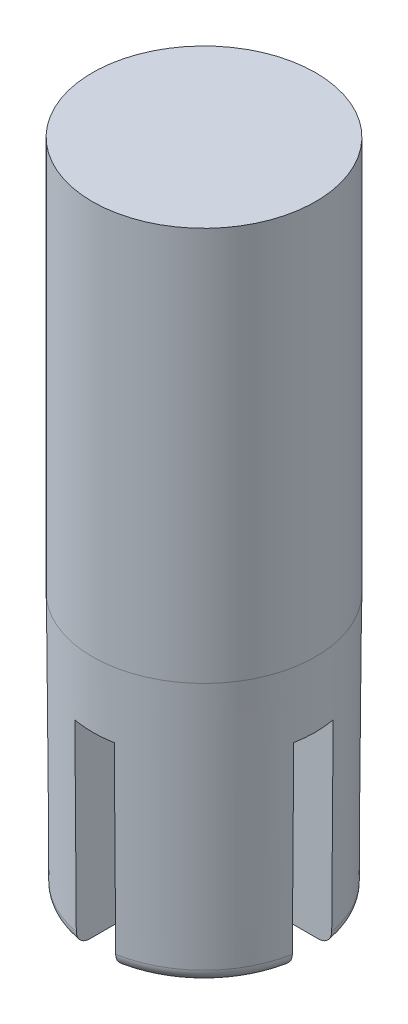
ISO-10303-21;
HEADER;
FILE_DESCRIPTION(('STEP AP214'),'2;1');
FILE_NAME('part.step','',(''),(''),'','','');
FILE_SCHEMA(('AUTOMOTIVE_DESIGN { 1 0 10303 214 1 1 1 1 }'));
ENDSEC;
DATA;
#1=APPLICATION_CONTEXT('core data for automotive mechanical design processes');
#2=APPLICATION_PROTOCOL_DEFINITION('international standard','automotive_design',2000,#1);
#3=PRODUCT_CONTEXT('',#1,'mechanical');
#4=PRODUCT('Part','Part','',(#3));
#5=PRODUCT_RELATED_PRODUCT_CATEGORY('part','',(#4));
#6=PRODUCT_DEFINITION_FORMATION('','',#4);
#7=PRODUCT_DEFINITION_CONTEXT('part definition',#1,'design');
#8=PRODUCT_DEFINITION('design','',#6,#7);
#9=PRODUCT_DEFINITION_SHAPE('','',#8);
#10=(LENGTH_UNIT() NAMED_UNIT(*) SI_UNIT(.MILLI.,.METRE.));
#11=(NAMED_UNIT(*) PLANE_ANGLE_UNIT() SI_UNIT($,.RADIAN.));
#12=(NAMED_UNIT(*) SI_UNIT($,.STERADIAN.) SOLID_ANGLE_UNIT());
#13=UNCERTAINTY_MEASURE_WITH_UNIT(LENGTH_MEASURE(1.E-05),#10,'distance_accuracy_value','');
#14=(GEOMETRIC_REPRESENTATION_CONTEXT(3) GLOBAL_UNCERTAINTY_ASSIGNED_CONTEXT((#13)) GLOBAL_UNIT_ASSIGNED_CONTEXT((#10,
#11,#12)) REPRESENTATION_CONTEXT('',''));
#15=CARTESIAN_POINT('',(0.,0.,0.));
#16=DIRECTION('',(0.,0.,1.));
#17=DIRECTION('',(1.,0.,0.));
#18=AXIS2_PLACEMENT_3D('',#15,#16,#17);
#19=CARTESIAN_POINT('',(-8.5,-66.,0.));
#20=DIRECTION('',(0.,-1.,0.));
#21=DIRECTION('',(0.,0.,-1.));
#22=AXIS2_PLACEMENT_3D('',#19,#20,#21);
#23=PLANE('',#22);
#24=DIRECTION('',(0.,0.,-1.));
#25=VECTOR('',#24,1.);
#26=CARTESIAN_POINT('',(-1.5,-66.,9.));
#27=LINE('',#26,#25);
#28=CARTESIAN_POINT('',(-1.5,-66.,7.20294331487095));
#29=VERTEX_POINT('',#28);
#30=CARTESIAN_POINT('',(-1.5,-66.,1.5));
#31=VERTEX_POINT('',#30);
#32=EDGE_CURVE('E335',#29,#31,#27,.T.);
#33=ORIENTED_EDGE('',*,*,#32,.F.);
#34=CARTESIAN_POINT('',(0.,-66.,0.));
#35=DIRECTION('',(0.,-1.,0.));
#36=DIRECTION('',(0.,0.,-1.));
#37=AXIS2_PLACEMENT_3D('',#34,#35,#36);
#38=CIRCLE('',#37,7.35747187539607);
#39=CARTESIAN_POINT('',(-7.20294331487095,-66.,1.5));
#40=VERTEX_POINT('',#39);
#41=EDGE_CURVE('E338',#29,#40,#38,.T.);
#42=ORIENTED_EDGE('',*,*,#41,.T.);
#43=DIRECTION('',(-1.,0.,0.));
#44=VECTOR('',#43,1.);
#45=CARTESIAN_POINT('',(9.,-66.,1.5));
#46=LINE('',#45,#44);
#47=EDGE_CURVE('E164',#31,#40,#46,.T.);
#48=ORIENTED_EDGE('',*,*,#47,.F.);
#49=EDGE_LOOP('',(#33,#42,#48));
#50=FACE_BOUND('',#49,.T.);
#51=ADVANCED_FACE('F16',(#50),#23,.T.);
#52=DIRECTION('',(1.,0.,0.));
#53=VECTOR('',#52,1.);
#54=CARTESIAN_POINT('',(9.,-66.,-1.5));
#55=LINE('',#54,#53);
#56=CARTESIAN_POINT('',(-7.20294331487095,-66.,-1.5));
#57=VERTEX_POINT('',#56);
#58=CARTESIAN_POINT('',(-1.5,-66.,-1.5));
#59=VERTEX_POINT('',#58);
#60=EDGE_CURVE('E161',#57,#59,#55,.T.);
#61=ORIENTED_EDGE('',*,*,#60,.F.);
#62=CARTESIAN_POINT('',(0.,-66.,0.));
#63=DIRECTION('',(0.,-1.,0.));
#64=DIRECTION('',(0.,0.,-1.));
#65=AXIS2_PLACEMENT_3D('',#62,#63,#64);
#66=CIRCLE('',#65,7.35747187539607);
#67=CARTESIAN_POINT('',(-1.5,-66.,-7.20294331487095));
#68=VERTEX_POINT('',#67);
#69=EDGE_CURVE('E248',#57,#68,#66,.T.);
#70=ORIENTED_EDGE('',*,*,#69,.T.);
#71=EDGE_CURVE('E418',#59,#68,#27,.T.);
#72=ORIENTED_EDGE('',*,*,#71,.F.);
#73=EDGE_LOOP('',(#61,#70,#72));
#74=FACE_BOUND('',#73,.T.);
#75=ADVANCED_FACE('F369',(#74),#23,.T.);
#76=CARTESIAN_POINT('',(9.,-51.,1.5));
#77=DIRECTION('',(0.,0.,1.));
#78=DIRECTION('',(1.,0.,0.));
#79=AXIS2_PLACEMENT_3D('',#76,#77,#78);
#80=PLANE('',#79);
#81=ORIENTED_EDGE('',*,*,#47,.T.);
#82=CARTESIAN_POINT('',(-7.20294331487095,-66.,1.5));
#83=CARTESIAN_POINT('',(-7.26111337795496,-66.0000452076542,1.5));
#84=CARTESIAN_POINT('',(-7.31928035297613,-65.9951377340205,1.5));
#85=CARTESIAN_POINT('',(-7.4339806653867,-65.9757080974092,1.5));
#86=CARTESIAN_POINT('',(-7.49051415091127,-65.961186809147,1.5));
#87=CARTESIAN_POINT('',(-7.60037486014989,-65.9228048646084,1.5));
#88=CARTESIAN_POINT('',(-7.65369949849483,-65.8989367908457,1.5));
#89=CARTESIAN_POINT('',(-7.75550067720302,-65.8424944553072,1.5));
#90=CARTESIAN_POINT('',(-7.80397914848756,-65.8099236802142,1.5));
#91=CARTESIAN_POINT('',(-7.89410785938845,-65.7373720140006,1.5));
#92=CARTESIAN_POINT('',(-7.93583076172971,-65.6974814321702,1.5));
#93=CARTESIAN_POINT('',(-8.01184875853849,-65.6111356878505,1.5));
#94=CARTESIAN_POINT('',(-8.04614248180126,-65.5646793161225,1.5));
#95=CARTESIAN_POINT('',(-8.10567289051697,-65.467423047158,1.5));
#96=CARTESIAN_POINT('',(-8.13105895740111,-65.4167144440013,1.5));
#97=CARTESIAN_POINT('',(-8.17279851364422,-65.311729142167,1.5));
#98=CARTESIAN_POINT('',(-8.1891600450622,-65.257455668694,1.5));
#99=CARTESIAN_POINT('',(-8.20748235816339,-65.1701961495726,1.5));
#100=CARTESIAN_POINT('',(-8.21260524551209,-65.1378419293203,1.5));
#101=CARTESIAN_POINT('',(-8.21960372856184,-65.0728342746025,1.5));
#102=CARTESIAN_POINT('',(-8.2214842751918,-65.0401813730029,1.5));
#103=CARTESIAN_POINT('',(-8.22173132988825,-65.0074997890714,1.5));
#104=B_SPLINE_CURVE_WITH_KNOTS('',3,(#82,#83,#84,#85,#86,#87,#88,#89,#90,#91,#92,#93,#94,#95,
#96,#97,#98,#99,#100,#101,#102,#103),.UNSPECIFIED.,.F.,.F.,(4,2,2,2,2,2,2,2,2,2,4),(0.,
0.174300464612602,0.348585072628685,0.523008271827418,0.697361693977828,0.869693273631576,
1.04205663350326,1.21137321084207,1.38053865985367,1.47866364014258,1.57663865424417),.UNSPECIFIED.);
#105=CARTESIAN_POINT('',(-8.22173132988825,-65.0074997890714,1.5));
#106=VERTEX_POINT('',#105);
#107=EDGE_CURVE('E30',#40,#106,#104,.T.);
#108=ORIENTED_EDGE('',*,*,#107,.T.);
#109=CARTESIAN_POINT('',(-8.10174468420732,-80.7421795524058,1.5));
#110=CARTESIAN_POINT('',(-8.14395734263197,-75.2078775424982,1.5));
#111=CARTESIAN_POINT('',(-8.18615910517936,-69.6735754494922,1.5));
#112=CARTESIAN_POINT('',(-8.27054175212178,-58.6049711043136,1.5));
#113=CARTESIAN_POINT('',(-8.31272263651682,-53.0706688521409,1.5));
#114=CARTESIAN_POINT('',(-8.46127619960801,-33.575227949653,1.5));
#115=CARTESIAN_POINT('',(-8.56759533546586,-19.6140888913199,1.5));
#116=CARTESIAN_POINT('',(-8.67385827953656,-5.6529494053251,1.5));
#117=B_SPLINE_CURVE_WITH_KNOTS('',3,(#109,#110,#111,#112,#113,#114,#115,#116),.UNSPECIFIED.,.F.,
.F.,(4,2,2,4),(0.,16.6033889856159,33.2067779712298,75.0914096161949),.UNSPECIFIED.);
#118=CARTESIAN_POINT('',(-8.3284996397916,-51.,1.5));
#119=VERTEX_POINT('',#118);
#120=EDGE_CURVE('E316',#106,#119,#117,.T.);
#121=ORIENTED_EDGE('',*,*,#120,.T.);
#122=DIRECTION('',(-1.,0.,0.));
#123=VECTOR('',#122,1.);
#124=CARTESIAN_POINT('',(9.,-51.,1.5));
#125=LINE('',#124,#123);
#126=CARTESIAN_POINT('',(-1.5,-51.,1.5));
#127=VERTEX_POINT('',#126);
#128=EDGE_CURVE('E294',#127,#119,#125,.T.);
#129=ORIENTED_EDGE('',*,*,#128,.F.);
#130=DIRECTION('',(0.,-1.,0.));
#131=VECTOR('',#130,1.);
#132=CARTESIAN_POINT('',(-1.5,-51.,1.5));
#133=LINE('',#132,#131);
#134=EDGE_CURVE('E278',#127,#31,#133,.T.);
#135=ORIENTED_EDGE('',*,*,#134,.T.);
#136=EDGE_LOOP('',(#81,#108,#121,#129,#135));
#137=FACE_BOUND('',#136,.T.);
#138=ADVANCED_FACE('F326',(#137),#80,.F.);
#139=CARTESIAN_POINT('',(9.,-51.,-1.5));
#140=DIRECTION('',(0.,0.,-1.));
#141=DIRECTION('',(-1.,0.,0.));
#142=AXIS2_PLACEMENT_3D('',#139,#140,#141);
#143=PLANE('',#142);
#144=CARTESIAN_POINT('',(-8.10174468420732,-80.7421795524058,-1.5));
#145=CARTESIAN_POINT('',(-8.14395734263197,-75.2078775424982,-1.5));
#146=CARTESIAN_POINT('',(-8.18615910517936,-69.6735754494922,-1.5));
#147=CARTESIAN_POINT('',(-8.27054175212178,-58.6049711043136,-1.5));
#148=CARTESIAN_POINT('',(-8.31272263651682,-53.0706688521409,-1.5));
#149=CARTESIAN_POINT('',(-8.46127619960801,-33.575227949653,-1.5));
#150=CARTESIAN_POINT('',(-8.56759533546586,-19.6140888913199,-1.5));
#151=CARTESIAN_POINT('',(-8.67385827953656,-5.6529494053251,-1.5));
#152=B_SPLINE_CURVE_WITH_KNOTS('',3,(#144,#145,#146,#147,#148,#149,#150,#151),.UNSPECIFIED.,.F.,
.F.,(4,2,2,4),(0.,16.6033889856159,33.2067779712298,75.0914096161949),.UNSPECIFIED.);
#153=CARTESIAN_POINT('',(-8.3284996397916,-51.,-1.5));
#154=VERTEX_POINT('',#153);
#155=CARTESIAN_POINT('',(-8.22173132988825,-65.0074997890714,-1.5));
#156=VERTEX_POINT('',#155);
#157=EDGE_CURVE('E215',#154,#156,#152,.F.);
#158=ORIENTED_EDGE('',*,*,#157,.T.);
#159=CARTESIAN_POINT('',(-8.22173132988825,-65.0074997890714,-1.5));
#160=CARTESIAN_POINT('',(-8.22151945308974,-65.0352946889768,-1.5));
#161=CARTESIAN_POINT('',(-8.22012887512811,-65.0630671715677,-1.5));
#162=CARTESIAN_POINT('',(-8.2150057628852,-65.1183930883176,-1.5));
#163=CARTESIAN_POINT('',(-8.21127341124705,-65.1459465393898,-1.5));
#164=CARTESIAN_POINT('',(-8.1966068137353,-65.2279102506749,-1.5));
#165=CARTESIAN_POINT('',(-8.18220200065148,-65.2817404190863,-1.5));
#166=CARTESIAN_POINT('',(-8.14457232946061,-65.3862106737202,-1.5));
#167=CARTESIAN_POINT('',(-8.12134452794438,-65.4368496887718,-1.5));
#168=CARTESIAN_POINT('',(-8.06677238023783,-65.5335470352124,-1.5));
#169=CARTESIAN_POINT('',(-8.03542852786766,-65.5796056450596,-1.5));
#170=CARTESIAN_POINT('',(-7.96531932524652,-65.6661831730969,-1.5));
#171=CARTESIAN_POINT('',(-7.92650591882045,-65.7066631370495,-1.5));
#172=CARTESIAN_POINT('',(-7.84271979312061,-65.7806608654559,-1.5));
#173=CARTESIAN_POINT('',(-7.79774572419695,-65.8141771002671,-1.5));
#174=CARTESIAN_POINT('',(-7.70217115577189,-65.8738601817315,-1.5));
#175=CARTESIAN_POINT('',(-7.65149285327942,-65.8999022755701,-1.5));
#176=CARTESIAN_POINT('',(-7.54654218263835,-65.9432679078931,-1.5));
#177=CARTESIAN_POINT('',(-7.49227103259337,-65.9605943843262,-1.5));
#178=CARTESIAN_POINT('',(-7.39860776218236,-65.9822237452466,-1.5));
#179=CARTESIAN_POINT('',(-7.35974344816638,-65.9888893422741,-1.5));
#180=CARTESIAN_POINT('',(-7.28157144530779,-65.9977766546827,-1.5));
#181=CARTESIAN_POINT('',(-7.2422645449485,-66.0000053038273,-1.5));
#182=CARTESIAN_POINT('',(-7.20294331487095,-66.,-1.5));
#183=B_SPLINE_CURVE_WITH_KNOTS('',3,(#159,#160,#161,#162,#163,#164,#165,#166,#167,#168,#169,
#170,#171,#172,#173,#174,#175,#176,#177,#178,#179,#180,#181,#182),.UNSPECIFIED.,.F.,.F.,(4,2,2,
2,2,2,2,2,2,2,2,4),(0.,0.0833355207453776,0.166664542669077,0.33297740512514,0.499345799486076,
0.665704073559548,0.833170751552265,1.0006741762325,1.17082944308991,1.34092731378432,
1.45898399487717,1.57685603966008),.UNSPECIFIED.);
#184=EDGE_CURVE('E401',#156,#57,#183,.T.);
#185=ORIENTED_EDGE('',*,*,#184,.T.);
#186=ORIENTED_EDGE('',*,*,#60,.T.);
#187=DIRECTION('',(0.,1.,0.));
#188=VECTOR('',#187,1.);
#189=CARTESIAN_POINT('',(-1.5,-51.,-1.5));
#190=LINE('',#189,#188);
#191=CARTESIAN_POINT('',(-1.5,-51.,-1.5));
#192=VERTEX_POINT('',#191);
#193=EDGE_CURVE('E275',#59,#192,#190,.T.);
#194=ORIENTED_EDGE('',*,*,#193,.T.);
#195=DIRECTION('',(1.,0.,0.));
#196=VECTOR('',#195,1.);
#197=CARTESIAN_POINT('',(9.,-51.,-1.5));
#198=LINE('',#197,#196);
#199=EDGE_CURVE('E292',#154,#192,#198,.T.);
#200=ORIENTED_EDGE('',*,*,#199,.F.);
#201=EDGE_LOOP('',(#158,#185,#186,#194,#200));
#202=FACE_BOUND('',#201,.T.);
#203=ADVANCED_FACE('F207',(#202),#143,.F.);
#204=CARTESIAN_POINT('',(7.20294331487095,-66.,1.5));
#205=VERTEX_POINT('',#204);
#206=CARTESIAN_POINT('',(1.5,-66.,1.5));
#207=VERTEX_POINT('',#206);
#208=EDGE_CURVE('E171',#205,#207,#46,.T.);
#209=ORIENTED_EDGE('',*,*,#208,.F.);
#210=CARTESIAN_POINT('',(0.,-66.,0.));
#211=DIRECTION('',(0.,-1.,0.));
#212=DIRECTION('',(0.,0.,-1.));
#213=AXIS2_PLACEMENT_3D('',#210,#211,#212);
#214=CIRCLE('',#213,7.35747187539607);
#215=CARTESIAN_POINT('',(1.5,-66.,7.20294331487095));
#216=VERTEX_POINT('',#215);
#217=EDGE_CURVE('E397',#205,#216,#214,.T.);
#218=ORIENTED_EDGE('',*,*,#217,.T.);
#219=DIRECTION('',(0.,0.,1.));
#220=VECTOR('',#219,1.);
#221=CARTESIAN_POINT('',(1.5,-66.,9.));
#222=LINE('',#221,#220);
#223=EDGE_CURVE('E148',#207,#216,#222,.T.);
#224=ORIENTED_EDGE('',*,*,#223,.F.);
#225=EDGE_LOOP('',(#209,#218,#224));
#226=FACE_BOUND('',#225,.T.);
#227=ADVANCED_FACE('F375',(#226),#23,.T.);
#228=CARTESIAN_POINT('',(0.,-16.,0.));
#229=DIRECTION('',(0.,1.,0.));
#230=DIRECTION('',(0.,0.,1.));
#231=AXIS2_PLACEMENT_3D('',#228,#229,#230);
#232=PLANE('',#231);
#233=CARTESIAN_POINT('',(0.,-16.,0.));
#234=DIRECTION('',(0.,1.,0.));
#235=DIRECTION('',(0.,0.,1.));
#236=AXIS2_PLACEMENT_3D('',#233,#234,#235);
#237=CIRCLE('',#236,8.5);
#238=CARTESIAN_POINT('',(0.,-16.,8.5));
#239=VERTEX_POINT('',#238);
#240=EDGE_CURVE('E173',#239,#239,#237,.T.);
#241=ORIENTED_EDGE('',*,*,#240,.T.);
#242=EDGE_LOOP('',(#241));
#243=FACE_BOUND('',#242,.T.);
#244=ADVANCED_FACE('F383',(#243),#232,.T.);
#245=CARTESIAN_POINT('',(0.,0.,0.));
#246=DIRECTION('',(0.,1.,0.));
#247=DIRECTION('',(0.,0.,1.));
#248=AXIS2_PLACEMENT_3D('',#245,#246,#247);
#249=CYLINDRICAL_SURFACE('',#248,8.5);
#250=CARTESIAN_POINT('',(0.,-46.000000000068,0.));
#251=DIRECTION('',(0.,-1.,0.));
#252=DIRECTION('',(0.,0.,-1.));
#253=AXIS2_PLACEMENT_3D('',#250,#251,#252);
#254=CIRCLE('',#253,8.5);
#255=CARTESIAN_POINT('',(0.,-46.000000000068,-8.5));
#256=VERTEX_POINT('',#255);
#257=EDGE_CURVE('E176',#256,#256,#254,.F.);
#258=ORIENTED_EDGE('',*,*,#257,.T.);
#259=EDGE_LOOP('',(#258));
#260=FACE_BOUND('',#259,.T.);
#261=ORIENTED_EDGE('',*,*,#240,.F.);
#262=EDGE_LOOP('',(#261));
#263=FACE_BOUND('',#262,.T.);
#264=ADVANCED_FACE('F377',(#260,#263),#249,.T.);
#265=CARTESIAN_POINT('',(1.5,-66.,-7.20294331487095));
#266=VERTEX_POINT('',#265);
#267=CARTESIAN_POINT('',(1.5,-66.,-1.5));
#268=VERTEX_POINT('',#267);
#269=EDGE_CURVE('E134',#266,#268,#222,.T.);
#270=ORIENTED_EDGE('',*,*,#269,.F.);
#271=CARTESIAN_POINT('',(0.,-66.,0.));
#272=DIRECTION('',(0.,-1.,0.));
#273=DIRECTION('',(0.,0.,-1.));
#274=AXIS2_PLACEMENT_3D('',#271,#272,#273);
#275=CIRCLE('',#274,7.35747187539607);
#276=CARTESIAN_POINT('',(7.20294331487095,-66.,-1.5));
#277=VERTEX_POINT('',#276);
#278=EDGE_CURVE('E160',#266,#277,#275,.T.);
#279=ORIENTED_EDGE('',*,*,#278,.T.);
#280=EDGE_CURVE('E153',#268,#277,#55,.T.);
#281=ORIENTED_EDGE('',*,*,#280,.F.);
#282=EDGE_LOOP('',(#270,#279,#281));
#283=FACE_BOUND('',#282,.T.);
#284=ADVANCED_FACE('F159',(#283),#23,.T.);
#285=CARTESIAN_POINT('',(0.,-46.000000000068,0.));
#286=DIRECTION('',(0.,1.,0.));
#287=DIRECTION('',(0.,0.,1.));
#288=AXIS2_PLACEMENT_3D('',#285,#286,#287);
#289=CONICAL_SURFACE('',#288,8.5,0.00749985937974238);
#290=CARTESIAN_POINT('',(8.10174468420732,-80.7421795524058,-1.5));
#291=CARTESIAN_POINT('',(8.14395734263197,-75.2078775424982,-1.5));
#292=CARTESIAN_POINT('',(8.18615910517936,-69.6735754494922,-1.5));
#293=CARTESIAN_POINT('',(8.27054175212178,-58.6049711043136,-1.5));
#294=CARTESIAN_POINT('',(8.31272263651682,-53.0706688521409,-1.5));
#295=CARTESIAN_POINT('',(8.46127619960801,-33.575227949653,-1.5));
#296=CARTESIAN_POINT('',(8.56759533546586,-19.6140888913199,-1.5));
#297=CARTESIAN_POINT('',(8.67385827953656,-5.6529494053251,-1.5));
#298=B_SPLINE_CURVE_WITH_KNOTS('',3,(#290,#291,#292,#293,#294,#295,#296,#297),.UNSPECIFIED.,.F.,
.F.,(4,2,2,4),(0.,16.6033889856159,33.2067779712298,75.0914096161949),.UNSPECIFIED.);
#299=CARTESIAN_POINT('',(8.22173132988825,-65.0074997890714,-1.5));
#300=VERTEX_POINT('',#299);
#301=CARTESIAN_POINT('',(8.3284996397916,-51.,-1.5));
#302=VERTEX_POINT('',#301);
#303=EDGE_CURVE('E182',#300,#302,#298,.T.);
#304=ORIENTED_EDGE('',*,*,#303,.F.);
#305=CARTESIAN_POINT('',(0.,-65.0074997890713,0.));
#306=DIRECTION('',(0.,-1.,0.));
#307=DIRECTION('',(0.,0.,-1.));
#308=AXIS2_PLACEMENT_3D('',#305,#306,#307);
#309=CIRCLE('',#308,8.35744375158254);
#310=CARTESIAN_POINT('',(1.5,-65.0074997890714,-8.22173132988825));
#311=VERTEX_POINT('',#310);
#312=EDGE_CURVE('E249',#300,#311,#309,.F.);
#313=ORIENTED_EDGE('',*,*,#312,.T.);
#314=CARTESIAN_POINT('',(1.5,-80.7421795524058,-8.10174468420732));
#315=CARTESIAN_POINT('',(1.5,-75.2078775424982,-8.14395734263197));
#316=CARTESIAN_POINT('',(1.5,-69.6735754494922,-8.18615910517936));
#317=CARTESIAN_POINT('',(1.5,-58.6049711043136,-8.27054175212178));
#318=CARTESIAN_POINT('',(1.5,-53.0706688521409,-8.31272263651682));
#319=CARTESIAN_POINT('',(1.5,-33.575227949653,-8.46127619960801));
#320=CARTESIAN_POINT('',(1.5,-19.6140888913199,-8.56759533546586));
#321=CARTESIAN_POINT('',(1.5,-5.6529494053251,-8.67385827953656));
#322=B_SPLINE_CURVE_WITH_KNOTS('',3,(#314,#315,#316,#317,#318,#319,#320,#321),.UNSPECIFIED.,.F.,
.F.,(4,2,2,4),(0.,16.6033889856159,33.2067779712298,75.0914096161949),.UNSPECIFIED.);
#323=CARTESIAN_POINT('',(1.5,-51.,-8.3284996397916));
#324=VERTEX_POINT('',#323);
#325=EDGE_CURVE('E269',#324,#311,#322,.F.);
#326=ORIENTED_EDGE('',*,*,#325,.F.);
#327=CARTESIAN_POINT('',(0.,-51.,0.));
#328=DIRECTION('',(0.,1.,0.));
#329=DIRECTION('',(0.,0.,1.));
#330=AXIS2_PLACEMENT_3D('',#327,#328,#329);
#331=CIRCLE('',#330,8.46250000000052);
#332=CARTESIAN_POINT('',(-1.5,-51.,-8.3284996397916));
#333=VERTEX_POINT('',#332);
#334=EDGE_CURVE('E162',#333,#324,#331,.F.);
#335=ORIENTED_EDGE('',*,*,#334,.F.);
#336=CARTESIAN_POINT('',(-1.5,-80.7421795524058,-8.10174468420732));
#337=CARTESIAN_POINT('',(-1.5,-75.2078775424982,-8.14395734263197));
#338=CARTESIAN_POINT('',(-1.5,-69.6735754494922,-8.18615910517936));
#339=CARTESIAN_POINT('',(-1.5,-58.6049711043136,-8.27054175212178));
#340=CARTESIAN_POINT('',(-1.5,-53.0706688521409,-8.31272263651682));
#341=CARTESIAN_POINT('',(-1.5,-33.575227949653,-8.46127619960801));
#342=CARTESIAN_POINT('',(-1.5,-19.6140888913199,-8.56759533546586));
#343=CARTESIAN_POINT('',(-1.5,-5.6529494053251,-8.67385827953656));
#344=B_SPLINE_CURVE_WITH_KNOTS('',3,(#336,#337,#338,#339,#340,#341,#342,#343),.UNSPECIFIED.,.F.,
.F.,(4,2,2,4),(0.,16.6033889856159,33.2067779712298,75.0914096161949),.UNSPECIFIED.);
#345=CARTESIAN_POINT('',(-1.5,-65.0074997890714,-8.22173132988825));
#346=VERTEX_POINT('',#345);
#347=EDGE_CURVE('E287',#346,#333,#344,.T.);
#348=ORIENTED_EDGE('',*,*,#347,.F.);
#349=CARTESIAN_POINT('',(0.,-65.0074997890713,0.));
#350=DIRECTION('',(0.,-1.,0.));
#351=DIRECTION('',(0.,0.,-1.));
#352=AXIS2_PLACEMENT_3D('',#349,#350,#351);
#353=CIRCLE('',#352,8.35744375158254);
#354=EDGE_CURVE('E423',#346,#156,#353,.F.);
#355=ORIENTED_EDGE('',*,*,#354,.T.);
#356=ORIENTED_EDGE('',*,*,#157,.F.);
#357=CARTESIAN_POINT('',(0.,-51.,0.));
#358=DIRECTION('',(0.,-1.,0.));
#359=DIRECTION('',(0.,0.,-1.));
#360=AXIS2_PLACEMENT_3D('',#357,#358,#359);
#361=CIRCLE('',#360,8.46250000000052);
#362=EDGE_CURVE('E183',#154,#119,#361,.F.);
#363=ORIENTED_EDGE('',*,*,#362,.T.);
#364=ORIENTED_EDGE('',*,*,#120,.F.);
#365=CARTESIAN_POINT('',(0.,-65.0074997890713,0.));
#366=DIRECTION('',(0.,-1.,0.));
#367=DIRECTION('',(0.,0.,-1.));
#368=AXIS2_PLACEMENT_3D('',#365,#366,#367);
#369=CIRCLE('',#368,8.35744375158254);
#370=CARTESIAN_POINT('',(-1.5,-65.0074997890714,8.22173132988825));
#371=VERTEX_POINT('',#370);
#372=EDGE_CURVE('E229',#106,#371,#369,.F.);
#373=ORIENTED_EDGE('',*,*,#372,.T.);
#374=CARTESIAN_POINT('',(-1.5,-80.7421795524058,8.10174468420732));
#375=CARTESIAN_POINT('',(-1.5,-75.2078775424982,8.14395734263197));
#376=CARTESIAN_POINT('',(-1.5,-69.6735754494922,8.18615910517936));
#377=CARTESIAN_POINT('',(-1.5,-58.6049711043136,8.27054175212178));
#378=CARTESIAN_POINT('',(-1.5,-53.0706688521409,8.31272263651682));
#379=CARTESIAN_POINT('',(-1.5,-33.575227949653,8.46127619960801));
#380=CARTESIAN_POINT('',(-1.5,-19.6140888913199,8.56759533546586));
#381=CARTESIAN_POINT('',(-1.5,-5.6529494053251,8.67385827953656));
#382=B_SPLINE_CURVE_WITH_KNOTS('',3,(#374,#375,#376,#377,#378,#379,#380,#381),.UNSPECIFIED.,.F.,
.F.,(4,2,2,4),(0.,16.6033889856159,33.2067779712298,75.0914096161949),.UNSPECIFIED.);
#383=CARTESIAN_POINT('',(-1.5,-51.,8.3284996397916));
#384=VERTEX_POINT('',#383);
#385=EDGE_CURVE('E281',#384,#371,#382,.F.);
#386=ORIENTED_EDGE('',*,*,#385,.F.);
#387=CARTESIAN_POINT('',(1.5,-51.,8.3284996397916));
#388=VERTEX_POINT('',#387);
#389=EDGE_CURVE('E165',#388,#384,#331,.F.);
#390=ORIENTED_EDGE('',*,*,#389,.F.);
#391=CARTESIAN_POINT('',(1.5,-80.7421795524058,8.10174468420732));
#392=CARTESIAN_POINT('',(1.5,-75.2078775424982,8.14395734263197));
#393=CARTESIAN_POINT('',(1.5,-69.6735754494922,8.18615910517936));
#394=CARTESIAN_POINT('',(1.5,-58.6049711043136,8.27054175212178));
#395=CARTESIAN_POINT('',(1.5,-53.0706688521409,8.31272263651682));
#396=CARTESIAN_POINT('',(1.5,-33.575227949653,8.46127619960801));
#397=CARTESIAN_POINT('',(1.5,-19.6140888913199,8.56759533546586));
#398=CARTESIAN_POINT('',(1.5,-5.6529494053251,8.67385827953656));
#399=B_SPLINE_CURVE_WITH_KNOTS('',3,(#391,#392,#393,#394,#395,#396,#397,#398),.UNSPECIFIED.,.F.,
.F.,(4,2,2,4),(0.,16.6033889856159,33.2067779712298,75.0914096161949),.UNSPECIFIED.);
#400=CARTESIAN_POINT('',(1.5,-65.0074997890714,8.22173132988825));
#401=VERTEX_POINT('',#400);
#402=EDGE_CURVE('E260',#401,#388,#399,.T.);
#403=ORIENTED_EDGE('',*,*,#402,.F.);
#404=CARTESIAN_POINT('',(0.,-65.0074997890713,0.));
#405=DIRECTION('',(0.,-1.,0.));
#406=DIRECTION('',(0.,0.,-1.));
#407=AXIS2_PLACEMENT_3D('',#404,#405,#406);
#408=CIRCLE('',#407,8.35744375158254);
#409=CARTESIAN_POINT('',(8.22173132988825,-65.0074997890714,1.5));
#410=VERTEX_POINT('',#409);
#411=EDGE_CURVE('E309',#401,#410,#408,.F.);
#412=ORIENTED_EDGE('',*,*,#411,.T.);
#413=CARTESIAN_POINT('',(8.10174468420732,-80.7421795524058,1.5));
#414=CARTESIAN_POINT('',(8.14395734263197,-75.2078775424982,1.5));
#415=CARTESIAN_POINT('',(8.18615910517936,-69.6735754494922,1.5));
#416=CARTESIAN_POINT('',(8.27054175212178,-58.6049711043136,1.5));
#417=CARTESIAN_POINT('',(8.31272263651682,-53.0706688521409,1.5));
#418=CARTESIAN_POINT('',(8.46127619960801,-33.575227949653,1.5));
#419=CARTESIAN_POINT('',(8.56759533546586,-19.6140888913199,1.5));
#420=CARTESIAN_POINT('',(8.67385827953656,-5.6529494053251,1.5));
#421=B_SPLINE_CURVE_WITH_KNOTS('',3,(#413,#414,#415,#416,#417,#418,#419,#420),.UNSPECIFIED.,.F.,
.F.,(4,2,2,4),(0.,16.6033889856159,33.2067779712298,75.0914096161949),.UNSPECIFIED.);
#422=CARTESIAN_POINT('',(8.3284996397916,-51.,1.5));
#423=VERTEX_POINT('',#422);
#424=EDGE_CURVE('E191',#423,#410,#421,.F.);
#425=ORIENTED_EDGE('',*,*,#424,.F.);
#426=EDGE_CURVE('E179',#423,#302,#361,.F.);
#427=ORIENTED_EDGE('',*,*,#426,.T.);
#428=EDGE_LOOP('',(#304,#313,#326,#335,#348,#355,#356,#363,#364,#373,#386,#390,#403,#412,#425,#427));
#429=FACE_BOUND('',#428,.T.);
#430=ORIENTED_EDGE('',*,*,#257,.F.);
#431=EDGE_LOOP('',(#430));
#432=FACE_BOUND('',#431,.T.);
#433=ADVANCED_FACE('F198',(#429,#432),#289,.T.);
#434=ORIENTED_EDGE('',*,*,#424,.T.);
#435=CARTESIAN_POINT('',(8.22173132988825,-65.0074997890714,1.5));
#436=CARTESIAN_POINT('',(8.22151945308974,-65.0352946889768,1.5));
#437=CARTESIAN_POINT('',(8.22012887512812,-65.0630671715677,1.5));
#438=CARTESIAN_POINT('',(8.2150057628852,-65.1183930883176,1.5));
#439=CARTESIAN_POINT('',(8.21127341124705,-65.1459465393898,1.5));
#440=CARTESIAN_POINT('',(8.19660681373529,-65.2279102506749,1.5));
#441=CARTESIAN_POINT('',(8.18220200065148,-65.2817404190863,1.5));
#442=CARTESIAN_POINT('',(8.14457232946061,-65.3862106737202,1.5));
#443=CARTESIAN_POINT('',(8.12134452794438,-65.4368496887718,1.5));
#444=CARTESIAN_POINT('',(8.06677238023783,-65.5335470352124,1.5));
#445=CARTESIAN_POINT('',(8.03542852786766,-65.5796056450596,1.5));
#446=CARTESIAN_POINT('',(7.96531932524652,-65.6661831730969,1.5));
#447=CARTESIAN_POINT('',(7.92650591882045,-65.7066631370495,1.5));
#448=CARTESIAN_POINT('',(7.8427197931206,-65.7806608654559,1.5));
#449=CARTESIAN_POINT('',(7.79774572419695,-65.8141771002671,1.5));
#450=CARTESIAN_POINT('',(7.70217115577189,-65.8738601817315,1.5));
#451=CARTESIAN_POINT('',(7.65149285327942,-65.8999022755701,1.5));
#452=CARTESIAN_POINT('',(7.54654218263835,-65.9432679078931,1.5));
#453=CARTESIAN_POINT('',(7.49227103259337,-65.9605943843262,1.5));
#454=CARTESIAN_POINT('',(7.39860776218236,-65.9822237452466,1.5));
#455=CARTESIAN_POINT('',(7.35974344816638,-65.9888893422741,1.5));
#456=CARTESIAN_POINT('',(7.28157144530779,-65.9977766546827,1.5));
#457=CARTESIAN_POINT('',(7.2422645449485,-66.0000053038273,1.5));
#458=CARTESIAN_POINT('',(7.20294331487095,-66.,1.5));
#459=B_SPLINE_CURVE_WITH_KNOTS('',3,(#435,#436,#437,#438,#439,#440,#441,#442,#443,#444,#445,
#446,#447,#448,#449,#450,#451,#452,#453,#454,#455,#456,#457,#458),.UNSPECIFIED.,.F.,.F.,(4,2,2,
2,2,2,2,2,2,2,2,4),(0.,0.0833355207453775,0.166664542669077,0.33297740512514,0.499345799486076,
0.665704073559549,0.833170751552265,1.0006741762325,1.17082944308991,1.34092731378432,
1.45898399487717,1.57685603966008),.UNSPECIFIED.);
#460=EDGE_CURVE('E339',#410,#205,#459,.T.);
#461=ORIENTED_EDGE('',*,*,#460,.T.);
#462=ORIENTED_EDGE('',*,*,#208,.T.);
#463=DIRECTION('',(0.,1.,0.));
#464=VECTOR('',#463,1.);
#465=CARTESIAN_POINT('',(1.5,-51.,1.5));
#466=LINE('',#465,#464);
#467=CARTESIAN_POINT('',(1.5,-51.,1.5));
#468=VERTEX_POINT('',#467);
#469=EDGE_CURVE('E156',#207,#468,#466,.T.);
#470=ORIENTED_EDGE('',*,*,#469,.T.);
#471=EDGE_CURVE('E169',#423,#468,#125,.T.);
#472=ORIENTED_EDGE('',*,*,#471,.F.);
#473=EDGE_LOOP('',(#434,#461,#462,#470,#472));
#474=FACE_BOUND('',#473,.T.);
#475=ADVANCED_FACE('F206',(#474),#80,.F.);
#476=ORIENTED_EDGE('',*,*,#280,.T.);
#477=CARTESIAN_POINT('',(7.20294331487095,-66.,-1.5));
#478=CARTESIAN_POINT('',(7.26111337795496,-66.0000452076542,-1.5));
#479=CARTESIAN_POINT('',(7.31928035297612,-65.9951377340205,-1.5));
#480=CARTESIAN_POINT('',(7.4339806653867,-65.9757080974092,-1.5));
#481=CARTESIAN_POINT('',(7.49051415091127,-65.961186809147,-1.5));
#482=CARTESIAN_POINT('',(7.60037486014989,-65.9228048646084,-1.5));
#483=CARTESIAN_POINT('',(7.65369949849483,-65.8989367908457,-1.5));
#484=CARTESIAN_POINT('',(7.75550067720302,-65.8424944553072,-1.5));
#485=CARTESIAN_POINT('',(7.80397914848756,-65.8099236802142,-1.5));
#486=CARTESIAN_POINT('',(7.89410785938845,-65.7373720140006,-1.5));
#487=CARTESIAN_POINT('',(7.93583076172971,-65.6974814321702,-1.5));
#488=CARTESIAN_POINT('',(8.01184875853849,-65.6111356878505,-1.5));
#489=CARTESIAN_POINT('',(8.04614248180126,-65.5646793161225,-1.5));
#490=CARTESIAN_POINT('',(8.10567289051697,-65.467423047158,-1.5));
#491=CARTESIAN_POINT('',(8.13105895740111,-65.4167144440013,-1.5));
#492=CARTESIAN_POINT('',(8.17279851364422,-65.311729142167,-1.5));
#493=CARTESIAN_POINT('',(8.1891600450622,-65.257455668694,-1.5));
#494=CARTESIAN_POINT('',(8.20748235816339,-65.1701961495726,-1.5));
#495=CARTESIAN_POINT('',(8.21260524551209,-65.1378419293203,-1.5));
#496=CARTESIAN_POINT('',(8.21960372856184,-65.0728342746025,-1.5));
#497=CARTESIAN_POINT('',(8.2214842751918,-65.0401813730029,-1.5));
#498=CARTESIAN_POINT('',(8.22173132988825,-65.0074997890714,-1.5));
#499=B_SPLINE_CURVE_WITH_KNOTS('',3,(#477,#478,#479,#480,#481,#482,#483,#484,#485,#486,#487,
#488,#489,#490,#491,#492,#493,#494,#495,#496,#497,#498),.UNSPECIFIED.,.F.,.F.,(4,2,2,2,2,2,2,2,
2,2,4),(0.,0.174300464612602,0.348585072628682,0.523008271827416,0.697361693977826,
0.869693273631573,1.04205663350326,1.21137321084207,1.38053865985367,1.47866364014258,
1.57663865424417),.UNSPECIFIED.);
#500=EDGE_CURVE('E222',#277,#300,#499,.T.);
#501=ORIENTED_EDGE('',*,*,#500,.T.);
#502=ORIENTED_EDGE('',*,*,#303,.T.);
#503=CARTESIAN_POINT('',(1.5,-51.,-1.5));
#504=VERTEX_POINT('',#503);
#505=EDGE_CURVE('E155',#504,#302,#198,.T.);
#506=ORIENTED_EDGE('',*,*,#505,.F.);
#507=DIRECTION('',(0.,-1.,0.));
#508=VECTOR('',#507,1.);
#509=CARTESIAN_POINT('',(1.5,-51.,-1.5));
#510=LINE('',#509,#508);
#511=EDGE_CURVE('E139',#504,#268,#510,.T.);
#512=ORIENTED_EDGE('',*,*,#511,.T.);
#513=EDGE_LOOP('',(#476,#501,#502,#506,#512));
#514=FACE_BOUND('',#513,.T.);
#515=ADVANCED_FACE('F152',(#514),#143,.F.);
#516=CARTESIAN_POINT('',(0.,-51.,0.));
#517=DIRECTION('',(0.,-1.,0.));
#518=DIRECTION('',(0.,0.,-1.));
#519=AXIS2_PLACEMENT_3D('',#516,#517,#518);
#520=PLANE('',#519);
#521=ORIENTED_EDGE('',*,*,#471,.T.);
#522=DIRECTION('',(0.,0.,1.));
#523=VECTOR('',#522,1.);
#524=CARTESIAN_POINT('',(1.5,-51.,9.));
#525=LINE('',#524,#523);
#526=EDGE_CURVE('E333',#468,#388,#525,.T.);
#527=ORIENTED_EDGE('',*,*,#526,.T.);
#528=ORIENTED_EDGE('',*,*,#389,.T.);
#529=DIRECTION('',(0.,0.,-1.));
#530=VECTOR('',#529,1.);
#531=CARTESIAN_POINT('',(-1.5,-51.,9.));
#532=LINE('',#531,#530);
#533=EDGE_CURVE('E328',#384,#127,#532,.T.);
#534=ORIENTED_EDGE('',*,*,#533,.T.);
#535=ORIENTED_EDGE('',*,*,#128,.T.);
#536=ORIENTED_EDGE('',*,*,#362,.F.);
#537=ORIENTED_EDGE('',*,*,#199,.T.);
#538=EDGE_CURVE('E147',#192,#333,#532,.T.);
#539=ORIENTED_EDGE('',*,*,#538,.T.);
#540=ORIENTED_EDGE('',*,*,#334,.T.);
#541=EDGE_CURVE('E157',#324,#504,#525,.T.);
#542=ORIENTED_EDGE('',*,*,#541,.T.);
#543=ORIENTED_EDGE('',*,*,#505,.T.);
#544=ORIENTED_EDGE('',*,*,#426,.F.);
#545=EDGE_LOOP('',(#521,#527,#528,#534,#535,#536,#537,#539,#540,#542,#543,#544));
#546=FACE_BOUND('',#545,.T.);
#547=ADVANCED_FACE('F205',(#546),#520,.T.);
#548=CARTESIAN_POINT('',(1.5,-51.,9.));
#549=DIRECTION('',(1.,0.,0.));
#550=DIRECTION('',(0.,0.,-1.));
#551=AXIS2_PLACEMENT_3D('',#548,#549,#550);
#552=PLANE('',#551);
#553=ORIENTED_EDGE('',*,*,#325,.T.);
#554=CARTESIAN_POINT('',(1.5,-65.0074997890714,-8.22173132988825));
#555=CARTESIAN_POINT('',(1.5,-65.0352946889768,-8.22151945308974));
#556=CARTESIAN_POINT('',(1.5,-65.0630671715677,-8.22012887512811));
#557=CARTESIAN_POINT('',(1.5,-65.1183930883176,-8.2150057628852));
#558=CARTESIAN_POINT('',(1.5,-65.1459465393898,-8.21127341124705));
#559=CARTESIAN_POINT('',(1.5,-65.2279102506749,-8.1966068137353));
#560=CARTESIAN_POINT('',(1.5,-65.2817404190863,-8.18220200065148));
#561=CARTESIAN_POINT('',(1.5,-65.3862106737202,-8.14457232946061));
#562=CARTESIAN_POINT('',(1.5,-65.4368496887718,-8.12134452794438));
#563=CARTESIAN_POINT('',(1.5,-65.5335470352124,-8.06677238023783));
#564=CARTESIAN_POINT('',(1.5,-65.5796056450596,-8.03542852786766));
#565=CARTESIAN_POINT('',(1.5,-65.6661831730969,-7.96531932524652));
#566=CARTESIAN_POINT('',(1.5,-65.7066631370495,-7.92650591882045));
#567=CARTESIAN_POINT('',(1.5,-65.7806608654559,-7.84271979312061));
#568=CARTESIAN_POINT('',(1.5,-65.8141771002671,-7.79774572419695));
#569=CARTESIAN_POINT('',(1.5,-65.8738601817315,-7.70217115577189));
#570=CARTESIAN_POINT('',(1.5,-65.8999022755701,-7.65149285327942));
#571=CARTESIAN_POINT('',(1.5,-65.9432679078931,-7.54654218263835));
#572=CARTESIAN_POINT('',(1.5,-65.9605943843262,-7.49227103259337));
#573=CARTESIAN_POINT('',(1.5,-65.9822237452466,-7.39860776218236));
#574=CARTESIAN_POINT('',(1.5,-65.9888893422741,-7.35974344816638));
#575=CARTESIAN_POINT('',(1.5,-65.9977766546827,-7.28157144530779));
#576=CARTESIAN_POINT('',(1.5,-66.0000053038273,-7.2422645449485));
#577=CARTESIAN_POINT('',(1.5,-66.,-7.20294331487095));
#578=B_SPLINE_CURVE_WITH_KNOTS('',3,(#554,#555,#556,#557,#558,#559,#560,#561,#562,#563,#564,
#565,#566,#567,#568,#569,#570,#571,#572,#573,#574,#575,#576,#577),.UNSPECIFIED.,.F.,.F.,(4,2,2,
2,2,2,2,2,2,2,2,4),(0.,0.0833355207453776,0.166664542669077,0.33297740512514,0.499345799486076,
0.665704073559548,0.833170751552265,1.0006741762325,1.17082944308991,1.34092731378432,
1.45898399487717,1.57685603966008),.UNSPECIFIED.);
#579=EDGE_CURVE('E142',#311,#266,#578,.T.);
#580=ORIENTED_EDGE('',*,*,#579,.T.);
#581=ORIENTED_EDGE('',*,*,#269,.T.);
#582=ORIENTED_EDGE('',*,*,#511,.F.);
#583=ORIENTED_EDGE('',*,*,#541,.F.);
#584=EDGE_LOOP('',(#553,#580,#581,#582,#583));
#585=FACE_BOUND('',#584,.T.);
#586=ADVANCED_FACE('F137',(#585),#552,.F.);
#587=CARTESIAN_POINT('',(-1.5,-51.,9.));
#588=DIRECTION('',(-1.,0.,0.));
#589=DIRECTION('',(0.,0.,1.));
#590=AXIS2_PLACEMENT_3D('',#587,#588,#589);
#591=PLANE('',#590);
#592=ORIENTED_EDGE('',*,*,#71,.T.);
#593=CARTESIAN_POINT('',(-1.5,-66.,-7.20294331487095));
#594=CARTESIAN_POINT('',(-1.5,-66.0000452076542,-7.26111337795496));
#595=CARTESIAN_POINT('',(-1.5,-65.9951377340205,-7.31928035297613));
#596=CARTESIAN_POINT('',(-1.5,-65.9757080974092,-7.4339806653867));
#597=CARTESIAN_POINT('',(-1.5,-65.961186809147,-7.49051415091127));
#598=CARTESIAN_POINT('',(-1.5,-65.9228048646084,-7.60037486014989));
#599=CARTESIAN_POINT('',(-1.5,-65.8989367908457,-7.65369949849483));
#600=CARTESIAN_POINT('',(-1.5,-65.8424944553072,-7.75550067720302));
#601=CARTESIAN_POINT('',(-1.5,-65.8099236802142,-7.80397914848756));
#602=CARTESIAN_POINT('',(-1.5,-65.7373720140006,-7.89410785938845));
#603=CARTESIAN_POINT('',(-1.5,-65.6974814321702,-7.93583076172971));
#604=CARTESIAN_POINT('',(-1.5,-65.6111356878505,-8.01184875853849));
#605=CARTESIAN_POINT('',(-1.5,-65.5646793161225,-8.04614248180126));
#606=CARTESIAN_POINT('',(-1.5,-65.467423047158,-8.10567289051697));
#607=CARTESIAN_POINT('',(-1.5,-65.4167144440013,-8.13105895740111));
#608=CARTESIAN_POINT('',(-1.5,-65.311729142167,-8.17279851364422));
#609=CARTESIAN_POINT('',(-1.5,-65.257455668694,-8.1891600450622));
#610=CARTESIAN_POINT('',(-1.5,-65.1701961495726,-8.20748235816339));
#611=CARTESIAN_POINT('',(-1.5,-65.1378419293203,-8.21260524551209));
#612=CARTESIAN_POINT('',(-1.5,-65.0728342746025,-8.21960372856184));
#613=CARTESIAN_POINT('',(-1.5,-65.0401813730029,-8.2214842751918));
#614=CARTESIAN_POINT('',(-1.5,-65.0074997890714,-8.22173132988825));
#615=B_SPLINE_CURVE_WITH_KNOTS('',3,(#593,#594,#595,#596,#597,#598,#599,#600,#601,#602,#603,
#604,#605,#606,#607,#608,#609,#610,#611,#612,#613,#614),.UNSPECIFIED.,.F.,.F.,(4,2,2,2,2,2,2,2,
2,2,4),(0.,0.174300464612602,0.348585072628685,0.523008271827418,0.697361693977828,
0.869693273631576,1.04205663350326,1.21137321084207,1.38053865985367,1.47866364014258,
1.57663865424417),.UNSPECIFIED.);
#616=EDGE_CURVE('E402',#68,#346,#615,.T.);
#617=ORIENTED_EDGE('',*,*,#616,.T.);
#618=ORIENTED_EDGE('',*,*,#347,.T.);
#619=ORIENTED_EDGE('',*,*,#538,.F.);
#620=ORIENTED_EDGE('',*,*,#193,.F.);
#621=EDGE_LOOP('',(#592,#617,#618,#619,#620));
#622=FACE_BOUND('',#621,.T.);
#623=ADVANCED_FACE('F420',(#622),#591,.F.);
#624=ORIENTED_EDGE('',*,*,#385,.T.);
#625=CARTESIAN_POINT('',(-1.5,-65.0074997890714,8.22173132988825));
#626=CARTESIAN_POINT('',(-1.5,-65.0352946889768,8.22151945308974));
#627=CARTESIAN_POINT('',(-1.5,-65.0630671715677,8.22012887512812));
#628=CARTESIAN_POINT('',(-1.5,-65.1183930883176,8.2150057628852));
#629=CARTESIAN_POINT('',(-1.5,-65.1459465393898,8.21127341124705));
#630=CARTESIAN_POINT('',(-1.5,-65.2279102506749,8.19660681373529));
#631=CARTESIAN_POINT('',(-1.5,-65.2817404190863,8.18220200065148));
#632=CARTESIAN_POINT('',(-1.5,-65.3862106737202,8.14457232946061));
#633=CARTESIAN_POINT('',(-1.5,-65.4368496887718,8.12134452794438));
#634=CARTESIAN_POINT('',(-1.5,-65.5335470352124,8.06677238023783));
#635=CARTESIAN_POINT('',(-1.5,-65.5796056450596,8.03542852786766));
#636=CARTESIAN_POINT('',(-1.5,-65.6661831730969,7.96531932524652));
#637=CARTESIAN_POINT('',(-1.5,-65.7066631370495,7.92650591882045));
#638=CARTESIAN_POINT('',(-1.5,-65.7806608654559,7.8427197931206));
#639=CARTESIAN_POINT('',(-1.5,-65.8141771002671,7.79774572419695));
#640=CARTESIAN_POINT('',(-1.5,-65.8738601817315,7.70217115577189));
#641=CARTESIAN_POINT('',(-1.5,-65.8999022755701,7.65149285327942));
#642=CARTESIAN_POINT('',(-1.5,-65.9432679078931,7.54654218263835));
#643=CARTESIAN_POINT('',(-1.5,-65.9605943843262,7.49227103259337));
#644=CARTESIAN_POINT('',(-1.5,-65.9822237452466,7.39860776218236));
#645=CARTESIAN_POINT('',(-1.5,-65.9888893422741,7.35974344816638));
#646=CARTESIAN_POINT('',(-1.5,-65.9977766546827,7.28157144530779));
#647=CARTESIAN_POINT('',(-1.5,-66.0000053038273,7.2422645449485));
#648=CARTESIAN_POINT('',(-1.5,-66.,7.20294331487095));
#649=B_SPLINE_CURVE_WITH_KNOTS('',3,(#625,#626,#627,#628,#629,#630,#631,#632,#633,#634,#635,
#636,#637,#638,#639,#640,#641,#642,#643,#644,#645,#646,#647,#648),.UNSPECIFIED.,.F.,.F.,(4,2,2,
2,2,2,2,2,2,2,2,4),(0.,0.0833355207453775,0.166664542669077,0.33297740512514,0.499345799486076,
0.665704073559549,0.833170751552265,1.0006741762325,1.17082944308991,1.34092731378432,
1.45898399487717,1.57685603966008),.UNSPECIFIED.);
#650=EDGE_CURVE('E11',#371,#29,#649,.T.);
#651=ORIENTED_EDGE('',*,*,#650,.T.);
#652=ORIENTED_EDGE('',*,*,#32,.T.);
#653=ORIENTED_EDGE('',*,*,#134,.F.);
#654=ORIENTED_EDGE('',*,*,#533,.F.);
#655=EDGE_LOOP('',(#624,#651,#652,#653,#654));
#656=FACE_BOUND('',#655,.T.);
#657=ADVANCED_FACE('F254',(#656),#591,.F.);
#658=ORIENTED_EDGE('',*,*,#223,.T.);
#659=CARTESIAN_POINT('',(1.5,-66.,7.20294331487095));
#660=CARTESIAN_POINT('',(1.5,-66.0000452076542,7.26111337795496));
#661=CARTESIAN_POINT('',(1.5,-65.9951377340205,7.31928035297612));
#662=CARTESIAN_POINT('',(1.5,-65.9757080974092,7.4339806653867));
#663=CARTESIAN_POINT('',(1.5,-65.961186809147,7.49051415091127));
#664=CARTESIAN_POINT('',(1.5,-65.9228048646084,7.60037486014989));
#665=CARTESIAN_POINT('',(1.5,-65.8989367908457,7.65369949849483));
#666=CARTESIAN_POINT('',(1.5,-65.8424944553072,7.75550067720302));
#667=CARTESIAN_POINT('',(1.5,-65.8099236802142,7.80397914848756));
#668=CARTESIAN_POINT('',(1.5,-65.7373720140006,7.89410785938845));
#669=CARTESIAN_POINT('',(1.5,-65.6974814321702,7.93583076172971));
#670=CARTESIAN_POINT('',(1.5,-65.6111356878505,8.01184875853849));
#671=CARTESIAN_POINT('',(1.5,-65.5646793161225,8.04614248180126));
#672=CARTESIAN_POINT('',(1.5,-65.467423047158,8.10567289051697));
#673=CARTESIAN_POINT('',(1.5,-65.4167144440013,8.13105895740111));
#674=CARTESIAN_POINT('',(1.5,-65.311729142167,8.17279851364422));
#675=CARTESIAN_POINT('',(1.5,-65.257455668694,8.1891600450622));
#676=CARTESIAN_POINT('',(1.5,-65.1701961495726,8.20748235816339));
#677=CARTESIAN_POINT('',(1.5,-65.1378419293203,8.21260524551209));
#678=CARTESIAN_POINT('',(1.5,-65.0728342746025,8.21960372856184));
#679=CARTESIAN_POINT('',(1.5,-65.0401813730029,8.2214842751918));
#680=CARTESIAN_POINT('',(1.5,-65.0074997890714,8.22173132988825));
#681=B_SPLINE_CURVE_WITH_KNOTS('',3,(#659,#660,#661,#662,#663,#664,#665,#666,#667,#668,#669,
#670,#671,#672,#673,#674,#675,#676,#677,#678,#679,#680),.UNSPECIFIED.,.F.,.F.,(4,2,2,2,2,2,2,2,
2,2,4),(0.,0.174300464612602,0.348585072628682,0.523008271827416,0.697361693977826,
0.869693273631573,1.04205663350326,1.21137321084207,1.38053865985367,1.47866364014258,
1.57663865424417),.UNSPECIFIED.);
#682=EDGE_CURVE('E341',#216,#401,#681,.T.);
#683=ORIENTED_EDGE('',*,*,#682,.T.);
#684=ORIENTED_EDGE('',*,*,#402,.T.);
#685=ORIENTED_EDGE('',*,*,#526,.F.);
#686=ORIENTED_EDGE('',*,*,#469,.F.);
#687=EDGE_LOOP('',(#658,#683,#684,#685,#686));
#688=FACE_BOUND('',#687,.T.);
#689=ADVANCED_FACE('F236',(#688),#552,.F.);
#690=CARTESIAN_POINT('',(0.,-65.,0.));
#691=DIRECTION('',(0.,-1.,0.));
#692=DIRECTION('',(0.,0.,-1.));
#693=AXIS2_PLACEMENT_3D('',#690,#691,#692);
#694=TOROIDAL_SURFACE('',#693,7.35747187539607,1.);
#695=ORIENTED_EDGE('',*,*,#579,.F.);
#696=ORIENTED_EDGE('',*,*,#312,.F.);
#697=ORIENTED_EDGE('',*,*,#500,.F.);
#698=ORIENTED_EDGE('',*,*,#278,.F.);
#699=EDGE_LOOP('',(#695,#696,#697,#698));
#700=FACE_BOUND('',#699,.T.);
#701=ADVANCED_FACE('F231',(#700),#694,.T.);
#702=CARTESIAN_POINT('',(0.,-65.,0.));
#703=DIRECTION('',(0.,-1.,0.));
#704=DIRECTION('',(0.,0.,-1.));
#705=AXIS2_PLACEMENT_3D('',#702,#703,#704);
#706=TOROIDAL_SURFACE('',#705,7.35747187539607,1.);
#707=ORIENTED_EDGE('',*,*,#184,.F.);
#708=ORIENTED_EDGE('',*,*,#354,.F.);
#709=ORIENTED_EDGE('',*,*,#616,.F.);
#710=ORIENTED_EDGE('',*,*,#69,.F.);
#711=EDGE_LOOP('',(#707,#708,#709,#710));
#712=FACE_BOUND('',#711,.T.);
#713=ADVANCED_FACE('F235',(#712),#706,.T.);
#714=CARTESIAN_POINT('',(0.,-65.,0.));
#715=DIRECTION('',(0.,-1.,0.));
#716=DIRECTION('',(0.,0.,-1.));
#717=AXIS2_PLACEMENT_3D('',#714,#715,#716);
#718=TOROIDAL_SURFACE('',#717,7.35747187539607,1.);
#719=ORIENTED_EDGE('',*,*,#460,.F.);
#720=ORIENTED_EDGE('',*,*,#411,.F.);
#721=ORIENTED_EDGE('',*,*,#682,.F.);
#722=ORIENTED_EDGE('',*,*,#217,.F.);
#723=EDGE_LOOP('',(#719,#720,#721,#722));
#724=FACE_BOUND('',#723,.T.);
#725=ADVANCED_FACE('F356',(#724),#718,.T.);
#726=CARTESIAN_POINT('',(0.,-65.,0.));
#727=DIRECTION('',(0.,-1.,0.));
#728=DIRECTION('',(0.,0.,-1.));
#729=AXIS2_PLACEMENT_3D('',#726,#727,#728);
#730=TOROIDAL_SURFACE('',#729,7.35747187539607,1.);
#731=ORIENTED_EDGE('',*,*,#650,.F.);
#732=ORIENTED_EDGE('',*,*,#372,.F.);
#733=ORIENTED_EDGE('',*,*,#107,.F.);
#734=ORIENTED_EDGE('',*,*,#41,.F.);
#735=EDGE_LOOP('',(#731,#732,#733,#734));
#736=FACE_BOUND('',#735,.T.);
#737=ADVANCED_FACE('F18',(#736),#730,.T.);
#738=CLOSED_SHELL('',(#51,#75,#138,#203,#227,#244,#264,#284,#433,#475,#515,#547,#586,#623,#657,
#689,#701,#713,#725,#737));
#739=MANIFOLD_SOLID_BREP('B1',#738);
#740=ADVANCED_BREP_SHAPE_REPRESENTATION('',(#18,#739),#14);
#741=SHAPE_DEFINITION_REPRESENTATION(#9,#740);
ENDSEC;
END-ISO-10303-21;
